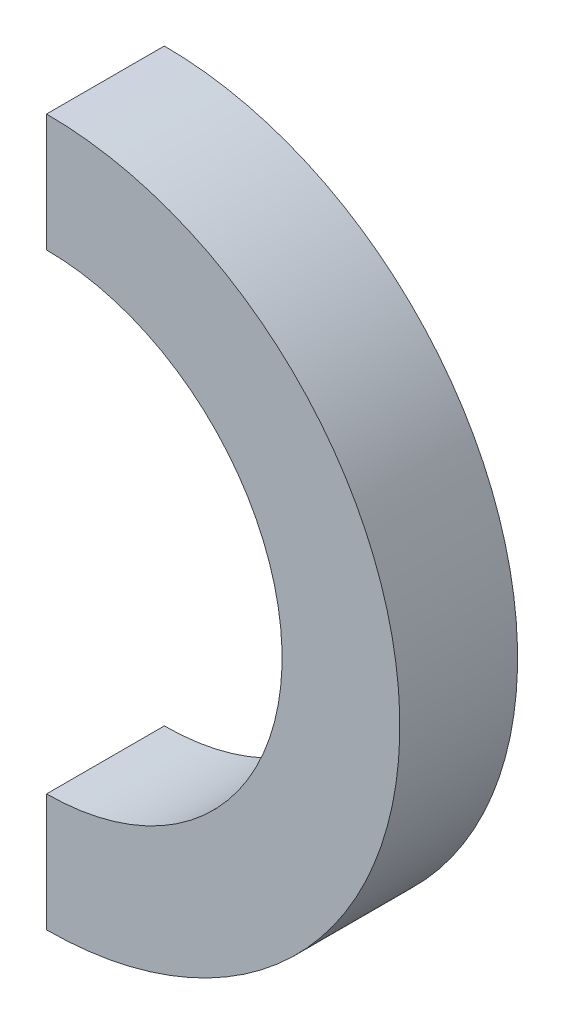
ISO-10303-21;
HEADER;
FILE_DESCRIPTION(('STEP AP214'),'2;1');
FILE_NAME('part.step','',(''),(''),'','','');
FILE_SCHEMA(('AUTOMOTIVE_DESIGN { 1 0 10303 214 1 1 1 1 }'));
ENDSEC;
DATA;
#1=APPLICATION_CONTEXT('core data for automotive mechanical design processes');
#2=APPLICATION_PROTOCOL_DEFINITION('international standard','automotive_design',2000,#1);
#3=PRODUCT_CONTEXT('',#1,'mechanical');
#4=PRODUCT('Part','Part','',(#3));
#5=PRODUCT_RELATED_PRODUCT_CATEGORY('part','',(#4));
#6=PRODUCT_DEFINITION_FORMATION('','',#4);
#7=PRODUCT_DEFINITION_CONTEXT('part definition',#1,'design');
#8=PRODUCT_DEFINITION('design','',#6,#7);
#9=PRODUCT_DEFINITION_SHAPE('','',#8);
#10=(LENGTH_UNIT() NAMED_UNIT(*) SI_UNIT(.MILLI.,.METRE.));
#11=(NAMED_UNIT(*) PLANE_ANGLE_UNIT() SI_UNIT($,.RADIAN.));
#12=(NAMED_UNIT(*) SI_UNIT($,.STERADIAN.) SOLID_ANGLE_UNIT());
#13=UNCERTAINTY_MEASURE_WITH_UNIT(LENGTH_MEASURE(1.E-05),#10,'distance_accuracy_value','');
#14=(GEOMETRIC_REPRESENTATION_CONTEXT(3) GLOBAL_UNCERTAINTY_ASSIGNED_CONTEXT((#13)) GLOBAL_UNIT_ASSIGNED_CONTEXT((#10,
#11,#12)) REPRESENTATION_CONTEXT('',''));
#15=CARTESIAN_POINT('',(0.,0.,0.));
#16=DIRECTION('',(0.,0.,1.));
#17=DIRECTION('',(1.,0.,0.));
#18=AXIS2_PLACEMENT_3D('',#15,#16,#17);
#19=CARTESIAN_POINT('',(0.,0.,6.35));
#20=DIRECTION('',(0.,0.,-1.));
#21=DIRECTION('',(-1.,0.,0.));
#22=AXIS2_PLACEMENT_3D('',#19,#20,#21);
#23=CYLINDRICAL_SURFACE('',#22,19.05);
#24=CARTESIAN_POINT('',(0.,0.,0.));
#25=DIRECTION('',(0.,0.,1.));
#26=DIRECTION('',(-1.,0.,0.));
#27=AXIS2_PLACEMENT_3D('',#24,#25,#26);
#28=CIRCLE('',#27,19.05);
#29=CARTESIAN_POINT('',(0.,-19.05,0.));
#30=VERTEX_POINT('',#29);
#31=CARTESIAN_POINT('',(0.,19.05,0.));
#32=VERTEX_POINT('',#31);
#33=EDGE_CURVE('E96',#30,#32,#28,.T.);
#34=ORIENTED_EDGE('',*,*,#33,.T.);
#35=DIRECTION('',(0.,0.,-1.));
#36=VECTOR('',#35,1.);
#37=CARTESIAN_POINT('',(0.,19.05,6.35));
#38=LINE('',#37,#36);
#39=CARTESIAN_POINT('',(0.,19.05,6.35));
#40=VERTEX_POINT('',#39);
#41=EDGE_CURVE('E11',#40,#32,#38,.T.);
#42=ORIENTED_EDGE('',*,*,#41,.F.);
#43=CARTESIAN_POINT('',(0.,0.,6.35));
#44=DIRECTION('',(0.,0.,1.));
#45=DIRECTION('',(-1.,0.,0.));
#46=AXIS2_PLACEMENT_3D('',#43,#44,#45);
#47=CIRCLE('',#46,19.05);
#48=CARTESIAN_POINT('',(0.,-19.05,6.35));
#49=VERTEX_POINT('',#48);
#50=EDGE_CURVE('E84',#49,#40,#47,.T.);
#51=ORIENTED_EDGE('',*,*,#50,.F.);
#52=DIRECTION('',(0.,0.,-1.));
#53=VECTOR('',#52,1.);
#54=CARTESIAN_POINT('',(0.,-19.05,6.35));
#55=LINE('',#54,#53);
#56=EDGE_CURVE('E92',#49,#30,#55,.T.);
#57=ORIENTED_EDGE('',*,*,#56,.T.);
#58=EDGE_LOOP('',(#34,#42,#51,#57));
#59=FACE_BOUND('',#58,.T.);
#60=ADVANCED_FACE('F33',(#59),#23,.T.);
#61=CARTESIAN_POINT('',(0.,19.05,6.35));
#62=DIRECTION('',(1.,0.,0.));
#63=DIRECTION('',(0.,1.,0.));
#64=AXIS2_PLACEMENT_3D('',#61,#62,#63);
#65=PLANE('',#64);
#66=DIRECTION('',(0.,-1.,0.));
#67=VECTOR('',#66,1.);
#68=CARTESIAN_POINT('',(0.,19.05,0.));
#69=LINE('',#68,#67);
#70=CARTESIAN_POINT('',(0.,12.7,0.));
#71=VERTEX_POINT('',#70);
#72=EDGE_CURVE('E88',#32,#71,#69,.T.);
#73=ORIENTED_EDGE('',*,*,#72,.T.);
#74=DIRECTION('',(0.,0.,-1.));
#75=VECTOR('',#74,1.);
#76=CARTESIAN_POINT('',(0.,12.7,6.35));
#77=LINE('',#76,#75);
#78=CARTESIAN_POINT('',(0.,12.7,6.35));
#79=VERTEX_POINT('',#78);
#80=EDGE_CURVE('E41',#79,#71,#77,.T.);
#81=ORIENTED_EDGE('',*,*,#80,.F.);
#82=DIRECTION('',(0.,-1.,0.));
#83=VECTOR('',#82,1.);
#84=CARTESIAN_POINT('',(0.,19.05,6.35));
#85=LINE('',#84,#83);
#86=EDGE_CURVE('E79',#40,#79,#85,.T.);
#87=ORIENTED_EDGE('',*,*,#86,.F.);
#88=ORIENTED_EDGE('',*,*,#41,.T.);
#89=EDGE_LOOP('',(#73,#81,#87,#88));
#90=FACE_BOUND('',#89,.T.);
#91=ADVANCED_FACE('F87',(#90),#65,.F.);
#92=CARTESIAN_POINT('',(0.,0.,6.35));
#93=DIRECTION('',(0.,0.,-1.));
#94=DIRECTION('',(-1.,0.,0.));
#95=AXIS2_PLACEMENT_3D('',#92,#93,#94);
#96=CYLINDRICAL_SURFACE('',#95,12.7);
#97=CARTESIAN_POINT('',(0.,0.,0.));
#98=DIRECTION('',(0.,0.,-1.));
#99=DIRECTION('',(-1.,0.,0.));
#100=AXIS2_PLACEMENT_3D('',#97,#98,#99);
#101=CIRCLE('',#100,12.7);
#102=CARTESIAN_POINT('',(0.,-12.7,0.));
#103=VERTEX_POINT('',#102);
#104=EDGE_CURVE('E66',#71,#103,#101,.T.);
#105=ORIENTED_EDGE('',*,*,#104,.T.);
#106=DIRECTION('',(0.,0.,-1.));
#107=VECTOR('',#106,1.);
#108=CARTESIAN_POINT('',(0.,-12.7,6.35));
#109=LINE('',#108,#107);
#110=CARTESIAN_POINT('',(0.,-12.7,6.35));
#111=VERTEX_POINT('',#110);
#112=EDGE_CURVE('E89',#111,#103,#109,.T.);
#113=ORIENTED_EDGE('',*,*,#112,.F.);
#114=CARTESIAN_POINT('',(0.,0.,6.35));
#115=DIRECTION('',(0.,0.,-1.));
#116=DIRECTION('',(-1.,0.,0.));
#117=AXIS2_PLACEMENT_3D('',#114,#115,#116);
#118=CIRCLE('',#117,12.7);
#119=EDGE_CURVE('E82',#79,#111,#118,.T.);
#120=ORIENTED_EDGE('',*,*,#119,.F.);
#121=ORIENTED_EDGE('',*,*,#80,.T.);
#122=EDGE_LOOP('',(#105,#113,#120,#121));
#123=FACE_BOUND('',#122,.T.);
#124=ADVANCED_FACE('F90',(#123),#96,.F.);
#125=CARTESIAN_POINT('',(0.,-12.7,6.35));
#126=DIRECTION('',(1.,0.,0.));
#127=DIRECTION('',(0.,1.,0.));
#128=AXIS2_PLACEMENT_3D('',#125,#126,#127);
#129=PLANE('',#128);
#130=DIRECTION('',(0.,-1.,0.));
#131=VECTOR('',#130,1.);
#132=CARTESIAN_POINT('',(0.,-12.7,0.));
#133=LINE('',#132,#131);
#134=EDGE_CURVE('E72',#103,#30,#133,.T.);
#135=ORIENTED_EDGE('',*,*,#134,.T.);
#136=ORIENTED_EDGE('',*,*,#56,.F.);
#137=DIRECTION('',(0.,-1.,0.));
#138=VECTOR('',#137,1.);
#139=CARTESIAN_POINT('',(0.,-12.7,6.35));
#140=LINE('',#139,#138);
#141=EDGE_CURVE('E49',#111,#49,#140,.T.);
#142=ORIENTED_EDGE('',*,*,#141,.F.);
#143=ORIENTED_EDGE('',*,*,#112,.T.);
#144=EDGE_LOOP('',(#135,#136,#142,#143));
#145=FACE_BOUND('',#144,.T.);
#146=ADVANCED_FACE('F103',(#145),#129,.F.);
#147=CARTESIAN_POINT('',(0.,0.,6.35));
#148=DIRECTION('',(0.,0.,-1.));
#149=DIRECTION('',(-1.,0.,0.));
#150=AXIS2_PLACEMENT_3D('',#147,#148,#149);
#151=PLANE('',#150);
#152=ORIENTED_EDGE('',*,*,#50,.T.);
#153=ORIENTED_EDGE('',*,*,#86,.T.);
#154=ORIENTED_EDGE('',*,*,#119,.T.);
#155=ORIENTED_EDGE('',*,*,#141,.T.);
#156=EDGE_LOOP('',(#152,#153,#154,#155));
#157=FACE_BOUND('',#156,.T.);
#158=ADVANCED_FACE('F80',(#157),#151,.F.);
#159=CARTESIAN_POINT('',(0.,0.,0.));
#160=DIRECTION('',(0.,0.,-1.));
#161=DIRECTION('',(-1.,0.,0.));
#162=AXIS2_PLACEMENT_3D('',#159,#160,#161);
#163=PLANE('',#162);
#164=ORIENTED_EDGE('',*,*,#33,.F.);
#165=ORIENTED_EDGE('',*,*,#134,.F.);
#166=ORIENTED_EDGE('',*,*,#104,.F.);
#167=ORIENTED_EDGE('',*,*,#72,.F.);
#168=EDGE_LOOP('',(#164,#165,#166,#167));
#169=FACE_BOUND('',#168,.T.);
#170=ADVANCED_FACE('F106',(#169),#163,.T.);
#171=CLOSED_SHELL('',(#60,#91,#124,#146,#158,#170));
#172=MANIFOLD_SOLID_BREP('B2',#171);
#173=ADVANCED_BREP_SHAPE_REPRESENTATION('',(#18,#172),#14);
#174=SHAPE_DEFINITION_REPRESENTATION(#9,#173);
ENDSEC;
END-ISO-10303-21;
